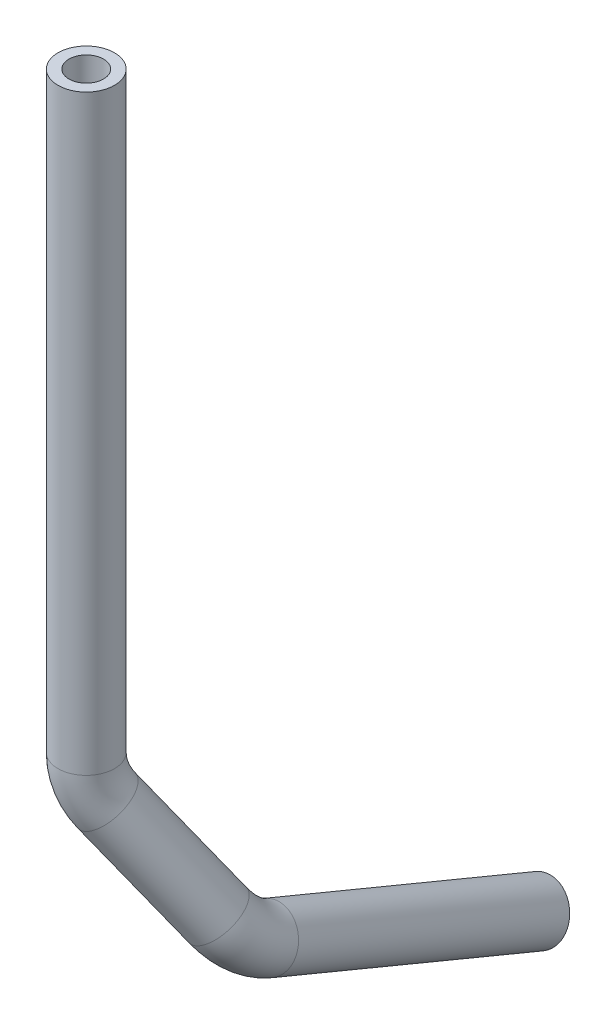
ISO-10303-21;
HEADER;
FILE_DESCRIPTION(('STEP AP214'),'2;1');
FILE_NAME('part.step','',(''),(''),'','','');
FILE_SCHEMA(('AUTOMOTIVE_DESIGN { 1 0 10303 214 1 1 1 1 }'));
ENDSEC;
DATA;
#1=APPLICATION_CONTEXT('core data for automotive mechanical design processes');
#2=APPLICATION_PROTOCOL_DEFINITION('international standard','automotive_design',2000,#1);
#3=PRODUCT_CONTEXT('',#1,'mechanical');
#4=PRODUCT('Part','Part','',(#3));
#5=PRODUCT_RELATED_PRODUCT_CATEGORY('part','',(#4));
#6=PRODUCT_DEFINITION_FORMATION('','',#4);
#7=PRODUCT_DEFINITION_CONTEXT('part definition',#1,'design');
#8=PRODUCT_DEFINITION('design','',#6,#7);
#9=PRODUCT_DEFINITION_SHAPE('','',#8);
#10=(LENGTH_UNIT() NAMED_UNIT(*) SI_UNIT(.MILLI.,.METRE.));
#11=(NAMED_UNIT(*) PLANE_ANGLE_UNIT() SI_UNIT($,.RADIAN.));
#12=(NAMED_UNIT(*) SI_UNIT($,.STERADIAN.) SOLID_ANGLE_UNIT());
#13=UNCERTAINTY_MEASURE_WITH_UNIT(LENGTH_MEASURE(1.E-05),#10,'distance_accuracy_value','');
#14=(GEOMETRIC_REPRESENTATION_CONTEXT(3) GLOBAL_UNCERTAINTY_ASSIGNED_CONTEXT((#13)) GLOBAL_UNIT_ASSIGNED_CONTEXT((#10,
#11,#12)) REPRESENTATION_CONTEXT('',''));
#15=CARTESIAN_POINT('',(0.,0.,0.));
#16=DIRECTION('',(0.,0.,1.));
#17=DIRECTION('',(1.,0.,0.));
#18=AXIS2_PLACEMENT_3D('',#15,#16,#17);
#19=CARTESIAN_POINT('',(0.,0.,0.));
#20=DIRECTION('',(0.,-1.,0.));
#21=DIRECTION('',(0.,0.,-1.));
#22=AXIS2_PLACEMENT_3D('',#19,#20,#21);
#23=CYLINDRICAL_SURFACE('',#22,7.9375);
#24=CARTESIAN_POINT('',(0.,-166.397905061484,0.));
#25=DIRECTION('',(0.,1.,0.));
#26=DIRECTION('',(0.,0.,1.));
#27=AXIS2_PLACEMENT_3D('',#24,#25,#26);
#28=CIRCLE('',#27,7.9375);
#29=CARTESIAN_POINT('',(-5.58286422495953,-166.397905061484,5.64229858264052));
#30=VERTEX_POINT('',#29);
#31=EDGE_CURVE('E116',#30,#30,#28,.T.);
#32=ORIENTED_EDGE('',*,*,#31,.T.);
#33=EDGE_LOOP('',(#32));
#34=FACE_BOUND('',#33,.T.);
#35=CARTESIAN_POINT('',(0.,0.,0.));
#36=DIRECTION('',(0.,1.,0.));
#37=DIRECTION('',(0.,0.,1.));
#38=AXIS2_PLACEMENT_3D('',#35,#36,#37);
#39=CIRCLE('',#38,7.9375);
#40=CARTESIAN_POINT('',(0.,0.,7.9375));
#41=VERTEX_POINT('',#40);
#42=EDGE_CURVE('E50',#41,#41,#39,.T.);
#43=ORIENTED_EDGE('',*,*,#42,.F.);
#44=EDGE_LOOP('',(#43));
#45=FACE_BOUND('',#44,.T.);
#46=ADVANCED_FACE('F35',(#34,#45),#23,.T.);
#47=CARTESIAN_POINT('',(13.3988741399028,-166.397905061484,-13.5415165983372));
#48=DIRECTION('',(0.710840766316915,0.,0.703352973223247));
#49=DIRECTION('',(0.703352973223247,0.,-0.710840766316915));
#50=AXIS2_PLACEMENT_3D('',#47,#48,#49);
#51=TOROIDAL_SURFACE('',#50,19.05,7.9375);
#52=CARTESIAN_POINT('',(2.88300891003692,-178.203353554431,-2.91370100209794));
#53=DIRECTION('',(-0.43587387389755,0.784832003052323,0.440514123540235));
#54=DIRECTION('',(0.10757796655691,-0.440514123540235,0.891276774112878));
#55=AXIS2_PLACEMENT_3D('',#52,#53,#54);
#56=CIRCLE('',#55,7.9375);
#57=CARTESIAN_POINT('',(-1.49860160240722,-183.122290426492,1.51455549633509));
#58=VERTEX_POINT('',#57);
#59=EDGE_CURVE('E119',#58,#58,#56,.T.);
#60=CARTESIAN_POINT('',(13.3988741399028,-166.397905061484,-13.5415165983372));
#61=DIRECTION('',(0.710840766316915,0.,0.703352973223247));
#62=DIRECTION('',(0.703352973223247,0.,-0.710840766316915));
#63=AXIS2_PLACEMENT_3D('',#60,#61,#62);
#64=CIRCLE('',#63,26.9875);
#65=EDGE_CURVE('',#30,#58,#64,.T.);
#66=ORIENTED_EDGE('',*,*,#31,.F.);
#67=ORIENTED_EDGE('',*,*,#59,.T.);
#68=ORIENTED_EDGE('',*,*,#65,.T.);
#69=ORIENTED_EDGE('',*,*,#65,.F.);
#70=EDGE_LOOP('',(#66,#68,#67,#69));
#71=FACE_BOUND('',#70,.T.);
#72=ADVANCED_FACE('F140',(#71),#51,.T.);
#73=CARTESIAN_POINT('',(2.88300891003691,-178.203353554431,-2.91370100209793));
#74=DIRECTION('',(0.435873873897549,-0.784832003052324,-0.440514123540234));
#75=DIRECTION('',(0.,0.489455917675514,-0.872028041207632));
#76=AXIS2_PLACEMENT_3D('',#73,#74,#75);
#77=CYLINDRICAL_SURFACE('',#76,7.9375);
#78=CARTESIAN_POINT('',(18.4061158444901,-206.154171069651,-18.6020646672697));
#79=DIRECTION('',(-0.435873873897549,0.784832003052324,0.440514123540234));
#80=DIRECTION('',(0.10757796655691,-0.440514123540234,0.891276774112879));
#81=AXIS2_PLACEMENT_3D('',#78,#79,#80);
#82=CIRCLE('',#81,7.9375);
#83=CARTESIAN_POINT('',(21.8679931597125,-208.090541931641,-11.7267625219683));
#84=VERTEX_POINT('',#83);
#85=EDGE_CURVE('E121',#84,#84,#82,.T.);
#86=ORIENTED_EDGE('',*,*,#85,.T.);
#87=EDGE_LOOP('',(#86));
#88=FACE_BOUND('',#87,.T.);
#89=ORIENTED_EDGE('',*,*,#59,.F.);
#90=EDGE_LOOP('',(#89));
#91=FACE_BOUND('',#90,.T.);
#92=ADVANCED_FACE('F136',(#88,#91),#77,.T.);
#93=CARTESIAN_POINT('',(10.0976102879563,-201.506881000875,-35.1027898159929));
#94=DIRECTION('',(0.787270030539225,0.569671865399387,-0.23596581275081));
#95=DIRECTION('',(-0.586226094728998,0.810147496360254,0.));
#96=AXIS2_PLACEMENT_3D('',#93,#94,#95);
#97=TOROIDAL_SURFACE('',#96,19.05,7.9375);
#98=CARTESIAN_POINT('',(21.844,-215.362758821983,-29.3634973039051));
#99=DIRECTION('',(0.,0.382683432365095,0.923879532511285));
#100=DIRECTION('',(0.27476012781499,-0.888321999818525,0.367955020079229));
#101=AXIS2_PLACEMENT_3D('',#98,#99,#100);
#102=CIRCLE('',#101,7.9375);
#103=CARTESIAN_POINT('',(26.7383290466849,-221.136041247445,-26.9721254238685));
#104=VERTEX_POINT('',#103);
#105=EDGE_CURVE('E39',#104,#104,#102,.T.);
#106=CARTESIAN_POINT('',(10.0976102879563,-201.506881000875,-35.1027898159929));
#107=DIRECTION('',(0.787270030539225,0.569671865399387,-0.23596581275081));
#108=DIRECTION('',(-0.586226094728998,0.810147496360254,0.));
#109=AXIS2_PLACEMENT_3D('',#106,#107,#108);
#110=CIRCLE('',#109,26.9875);
#111=EDGE_CURVE('',#84,#104,#110,.T.);
#112=ORIENTED_EDGE('',*,*,#85,.F.);
#113=ORIENTED_EDGE('',*,*,#105,.T.);
#114=ORIENTED_EDGE('',*,*,#111,.T.);
#115=ORIENTED_EDGE('',*,*,#111,.F.);
#116=EDGE_LOOP('',(#112,#114,#113,#115));
#117=FACE_BOUND('',#116,.T.);
#118=ADVANCED_FACE('F128',(#117),#97,.T.);
#119=CARTESIAN_POINT('',(21.844,-215.362758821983,-29.3634973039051));
#120=DIRECTION('',(0.,-0.382683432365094,-0.923879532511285));
#121=DIRECTION('',(0.,0.923879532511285,-0.382683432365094));
#122=AXIS2_PLACEMENT_3D('',#119,#120,#121);
#123=CYLINDRICAL_SURFACE('',#122,7.9375);
#124=CARTESIAN_POINT('',(21.844,-246.940716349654,-105.599430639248));
#125=DIRECTION('',(0.,0.382683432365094,0.923879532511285));
#126=DIRECTION('',(0.27476012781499,-0.888321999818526,0.367955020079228));
#127=AXIS2_PLACEMENT_3D('',#124,#125,#126);
#128=CIRCLE('',#127,7.9375);
#129=CARTESIAN_POINT('',(24.0249085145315,-253.991772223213,-102.678787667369));
#130=VERTEX_POINT('',#129);
#131=EDGE_CURVE('E55',#130,#130,#128,.T.);
#132=ORIENTED_EDGE('',*,*,#131,.T.);
#133=EDGE_LOOP('',(#132));
#134=FACE_BOUND('',#133,.T.);
#135=ORIENTED_EDGE('',*,*,#105,.F.);
#136=EDGE_LOOP('',(#135));
#137=FACE_BOUND('',#136,.T.);
#138=ADVANCED_FACE('F37',(#134,#137),#123,.T.);
#139=CARTESIAN_POINT('',(0.,0.,0.));
#140=DIRECTION('',(0.,1.,0.));
#141=DIRECTION('',(0.,0.,1.));
#142=AXIS2_PLACEMENT_3D('',#139,#140,#141);
#143=PLANE('',#142);
#144=CARTESIAN_POINT('',(0.,0.,0.));
#145=DIRECTION('',(0.,1.,0.));
#146=DIRECTION('',(0.,0.,1.));
#147=AXIS2_PLACEMENT_3D('',#144,#145,#146);
#148=CIRCLE('',#147,4.8641);
#149=CARTESIAN_POINT('',(0.,0.,4.8641));
#150=VERTEX_POINT('',#149);
#151=EDGE_CURVE('E103',#150,#150,#148,.F.);
#152=ORIENTED_EDGE('',*,*,#151,.T.);
#153=EDGE_LOOP('',(#152));
#154=FACE_BOUND('',#153,.T.);
#155=ORIENTED_EDGE('',*,*,#42,.T.);
#156=EDGE_LOOP('',(#155));
#157=FACE_BOUND('',#156,.T.);
#158=ADVANCED_FACE('F68',(#154,#157),#143,.T.);
#159=CARTESIAN_POINT('',(21.844,-246.940716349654,-105.599430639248));
#160=DIRECTION('',(0.,0.382683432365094,0.923879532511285));
#161=DIRECTION('',(0.27476012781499,-0.888321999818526,0.367955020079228));
#162=AXIS2_PLACEMENT_3D('',#159,#160,#161);
#163=PLANE('',#162);
#164=CARTESIAN_POINT('',(21.844,-246.940716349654,-105.599430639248));
#165=DIRECTION('',(0.,0.382683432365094,0.923879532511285));
#166=DIRECTION('',(0.27476012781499,-0.888321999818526,0.367955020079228));
#167=AXIS2_PLACEMENT_3D('',#164,#165,#166);
#168=CIRCLE('',#167,4.8641);
#169=CARTESIAN_POINT('',(23.1804607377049,-251.261603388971,-103.80966062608));
#170=VERTEX_POINT('',#169);
#171=EDGE_CURVE('E11',#170,#170,#168,.F.);
#172=ORIENTED_EDGE('',*,*,#171,.F.);
#173=EDGE_LOOP('',(#172));
#174=FACE_BOUND('',#173,.T.);
#175=ORIENTED_EDGE('',*,*,#131,.F.);
#176=EDGE_LOOP('',(#175));
#177=FACE_BOUND('',#176,.T.);
#178=ADVANCED_FACE('F65',(#174,#177),#163,.F.);
#179=CARTESIAN_POINT('',(0.,0.,0.));
#180=DIRECTION('',(0.,-1.,0.));
#181=DIRECTION('',(0.,0.,-1.));
#182=AXIS2_PLACEMENT_3D('',#179,#180,#181);
#183=CYLINDRICAL_SURFACE('',#182,4.8641);
#184=CARTESIAN_POINT('',(0.,-166.397905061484,0.));
#185=DIRECTION('',(0.,1.,0.));
#186=DIRECTION('',(0.,0.,1.));
#187=AXIS2_PLACEMENT_3D('',#184,#185,#186);
#188=CIRCLE('',#187,4.8641);
#189=CARTESIAN_POINT('',(-3.4211791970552,-166.397905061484,3.45760057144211));
#190=VERTEX_POINT('',#189);
#191=EDGE_CURVE('E102',#190,#190,#188,.F.);
#192=ORIENTED_EDGE('',*,*,#191,.T.);
#193=EDGE_LOOP('',(#192));
#194=FACE_BOUND('',#193,.T.);
#195=ORIENTED_EDGE('',*,*,#151,.F.);
#196=EDGE_LOOP('',(#195));
#197=FACE_BOUND('',#196,.T.);
#198=ADVANCED_FACE('F67',(#194,#197),#183,.F.);
#199=CARTESIAN_POINT('',(13.3988741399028,-166.397905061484,-13.5415165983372));
#200=DIRECTION('',(0.710840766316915,0.,0.703352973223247));
#201=DIRECTION('',(0.703352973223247,0.,-0.710840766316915));
#202=AXIS2_PLACEMENT_3D('',#199,#200,#201);
#203=TOROIDAL_SURFACE('',#202,19.05,4.8641);
#204=CARTESIAN_POINT('',(2.88300891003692,-178.203353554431,-2.91370100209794));
#205=DIRECTION('',(-0.43587387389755,0.784832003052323,0.440514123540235));
#206=DIRECTION('',(0.10757796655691,-0.440514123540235,0.891276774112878));
#207=AXIS2_PLACEMENT_3D('',#204,#205,#206);
#208=CIRCLE('',#207,4.8641);
#209=CARTESIAN_POINT('',(0.197957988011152,-181.21767806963,-0.200065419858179));
#210=VERTEX_POINT('',#209);
#211=EDGE_CURVE('E99',#210,#210,#208,.F.);
#212=CARTESIAN_POINT('',(13.3988741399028,-166.397905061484,-13.5415165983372));
#213=DIRECTION('',(0.710840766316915,0.,0.703352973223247));
#214=DIRECTION('',(0.703352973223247,0.,-0.710840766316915));
#215=AXIS2_PLACEMENT_3D('',#212,#213,#214);
#216=CIRCLE('',#215,23.9141);
#217=EDGE_CURVE('',#190,#210,#216,.T.);
#218=ORIENTED_EDGE('',*,*,#191,.F.);
#219=ORIENTED_EDGE('',*,*,#211,.T.);
#220=ORIENTED_EDGE('',*,*,#217,.T.);
#221=ORIENTED_EDGE('',*,*,#217,.F.);
#222=EDGE_LOOP('',(#218,#220,#219,#221));
#223=FACE_BOUND('',#222,.T.);
#224=ADVANCED_FACE('F74',(#223),#203,.F.);
#225=CARTESIAN_POINT('',(2.88300891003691,-178.203353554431,-2.91370100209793));
#226=DIRECTION('',(0.435873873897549,-0.784832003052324,-0.440514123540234));
#227=DIRECTION('',(0.,0.489455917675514,-0.872028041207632));
#228=AXIS2_PLACEMENT_3D('',#225,#226,#227);
#229=CYLINDRICAL_SURFACE('',#228,4.8641);
#230=CARTESIAN_POINT('',(18.4061158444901,-206.154171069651,-18.6020646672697));
#231=DIRECTION('',(-0.435873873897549,0.784832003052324,0.440514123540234));
#232=DIRECTION('',(0.10757796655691,-0.440514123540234,0.891276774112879));
#233=AXIS2_PLACEMENT_3D('',#230,#231,#232);
#234=CIRCLE('',#233,4.8641);
#235=CARTESIAN_POINT('',(20.5275542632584,-207.340779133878,-14.388879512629));
#236=VERTEX_POINT('',#235);
#237=EDGE_CURVE('E105',#236,#236,#234,.F.);
#238=ORIENTED_EDGE('',*,*,#237,.T.);
#239=EDGE_LOOP('',(#238));
#240=FACE_BOUND('',#239,.T.);
#241=ORIENTED_EDGE('',*,*,#211,.F.);
#242=EDGE_LOOP('',(#241));
#243=FACE_BOUND('',#242,.T.);
#244=ADVANCED_FACE('F85',(#240,#243),#229,.F.);
#245=CARTESIAN_POINT('',(10.0976102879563,-201.506881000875,-35.1027898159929));
#246=DIRECTION('',(0.787270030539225,0.569671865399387,-0.23596581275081));
#247=DIRECTION('',(-0.586226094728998,0.810147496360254,0.));
#248=AXIS2_PLACEMENT_3D('',#245,#246,#247);
#249=TOROIDAL_SURFACE('',#248,19.05,4.8641);
#250=CARTESIAN_POINT('',(21.844,-215.362758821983,-29.3634973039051));
#251=DIRECTION('',(0.,0.382683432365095,0.923879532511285));
#252=DIRECTION('',(0.27476012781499,-0.888321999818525,0.367955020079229));
#253=AXIS2_PLACEMENT_3D('',#250,#251,#252);
#254=CIRCLE('',#253,4.8641);
#255=CARTESIAN_POINT('',(24.8432448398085,-218.900626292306,-27.8980646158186));
#256=VERTEX_POINT('',#255);
#257=EDGE_CURVE('E44',#256,#256,#254,.F.);
#258=CARTESIAN_POINT('',(10.0976102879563,-201.506881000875,-35.1027898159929));
#259=DIRECTION('',(0.787270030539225,0.569671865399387,-0.23596581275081));
#260=DIRECTION('',(-0.586226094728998,0.810147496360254,0.));
#261=AXIS2_PLACEMENT_3D('',#258,#259,#260);
#262=CIRCLE('',#261,23.9141);
#263=EDGE_CURVE('',#236,#256,#262,.T.);
#264=ORIENTED_EDGE('',*,*,#237,.F.);
#265=ORIENTED_EDGE('',*,*,#257,.T.);
#266=ORIENTED_EDGE('',*,*,#263,.T.);
#267=ORIENTED_EDGE('',*,*,#263,.F.);
#268=EDGE_LOOP('',(#264,#266,#265,#267));
#269=FACE_BOUND('',#268,.T.);
#270=ADVANCED_FACE('F81',(#269),#249,.F.);
#271=CARTESIAN_POINT('',(21.844,-215.362758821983,-29.3634973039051));
#272=DIRECTION('',(0.,-0.382683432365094,-0.923879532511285));
#273=DIRECTION('',(0.,0.923879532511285,-0.382683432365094));
#274=AXIS2_PLACEMENT_3D('',#271,#272,#273);
#275=CYLINDRICAL_SURFACE('',#274,4.8641);
#276=ORIENTED_EDGE('',*,*,#171,.T.);
#277=EDGE_LOOP('',(#276));
#278=FACE_BOUND('',#277,.T.);
#279=ORIENTED_EDGE('',*,*,#257,.F.);
#280=EDGE_LOOP('',(#279));
#281=FACE_BOUND('',#280,.T.);
#282=ADVANCED_FACE('F62',(#278,#281),#275,.F.);
#283=CLOSED_SHELL('',(#46,#72,#92,#118,#138,#158,#178,#198,#224,#244,#270,#282));
#284=MANIFOLD_SOLID_BREP('B2',#283);
#285=ADVANCED_BREP_SHAPE_REPRESENTATION('',(#18,#284),#14);
#286=SHAPE_DEFINITION_REPRESENTATION(#9,#285);
ENDSEC;
END-ISO-10303-21;
